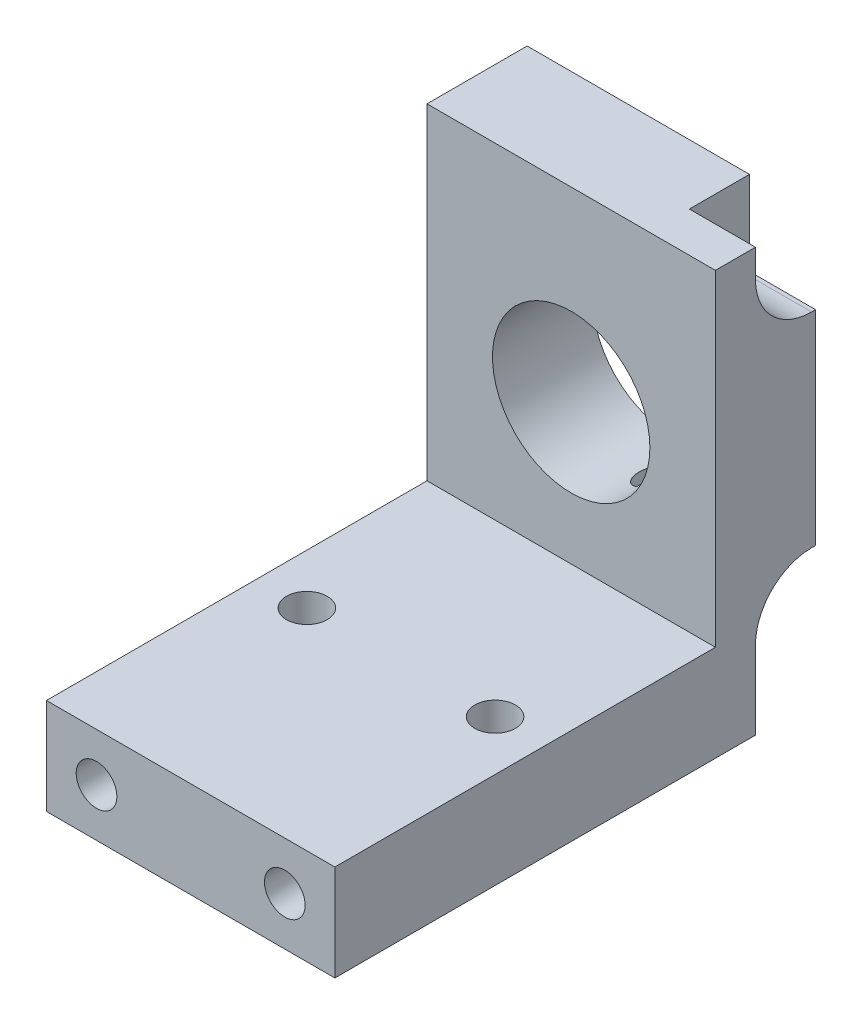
from build123d import *

# Parameters (mm, degrees)
SKETCH1_W                 = 18.288
SKETCH1_H                 = 26.797
EXTRUDE1_DEPTH            = 6.35
SKETCH2_R                 = 4.9911
CUT_EXTRUDE1_DEPTH        = 39.186262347
SKETCH3_W                 = 18.288
SKETCH3_H                 = 6.096
EXTRUDE2_DEPTH            = 24.13
SKETCH5_W                 = 8.42160022
SKETCH5_H                 = 9.132543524
CUT_EXTRUDE3_DEPTH        = 3.81
FILLET1_R                 = 3.556
F_5_40_TAPPED_HOLE1_D     = 2.5781
F_5_40_TAPPED_HOLE1_DEPTH = 10.541
F_5_40_TAPPED_HOLE2_D     = 2.5781
F_5_40_TAPPED_HOLE2_DEPTH = 9.525


with BuildPart() as part:
    # Sketch1 → Extrude1 (new body)
    with BuildSketch(Plane.XY):
        with Locations((25.4, -1.5875)):
            Rectangle(SKETCH1_W, SKETCH1_H)
    extrude(amount=EXTRUDE1_DEPTH)

    # Sketch2 → Cut-Extrude1 (cut, through all)
    with BuildSketch(Plane.XY.offset(6.35)):
        with Locations((25.4, 0)):
            Circle(SKETCH2_R)
    extrude(amount=-CUT_EXTRUDE1_DEPTH, mode=Mode.SUBTRACT)

    # Sketch3 → Extrude2 (add)
    with BuildSketch(Plane.XY.offset(6.35)):
        with Locations((25.4, -11.938)):
            Rectangle(SKETCH3_W, SKETCH3_H)
    extrude(amount=EXTRUDE2_DEPTH)

    # Sketch5 → Cut-Extrude3 (cut)
    with BuildSketch(Plane(origin=(0, 0, 0), x_dir=(-1, 0, 0), z_dir=(0, 0, -1))):
        with Locations((-34.56380011, -11.043271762)):
            Rectangle(SKETCH5_W, SKETCH5_H)
    cut_extrude3 = extrude(amount=-CUT_EXTRUDE3_DEPTH, mode=Mode.SUBTRACT)

    # Mirror1: Cut-Extrude3 across plane
    add(cut_extrude3.mirror(Plane.ZX), mode=Mode.SUBTRACT)

    # Fillet1
    fillet1_edges = [part.edges().sort_by_distance(p)[0] for p in [
        (32.4485, -6.477, 3.81),
        (32.4485, 6.477, 3.81),
    ]]
    fillet(fillet1_edges, radius=FILLET1_R)

    # 5-40 Tapped Hole1
    with Locations(Plane.XZ.offset(14.986)):
        with Locations((31.369, 17.145), (19.431, 17.145), (19.431, 3.175), (27.813, 3.175)):
            Hole(F_5_40_TAPPED_HOLE1_D / 2, depth=F_5_40_TAPPED_HOLE1_DEPTH)

    # 5-40 Tapped Hole2
    with Locations(Plane.XY.offset(30.48)):
        with Locations((19.431, -11.938), (31.369, -11.938)):
            Hole(F_5_40_TAPPED_HOLE2_D / 2, depth=F_5_40_TAPPED_HOLE2_DEPTH)


solid = part.part
